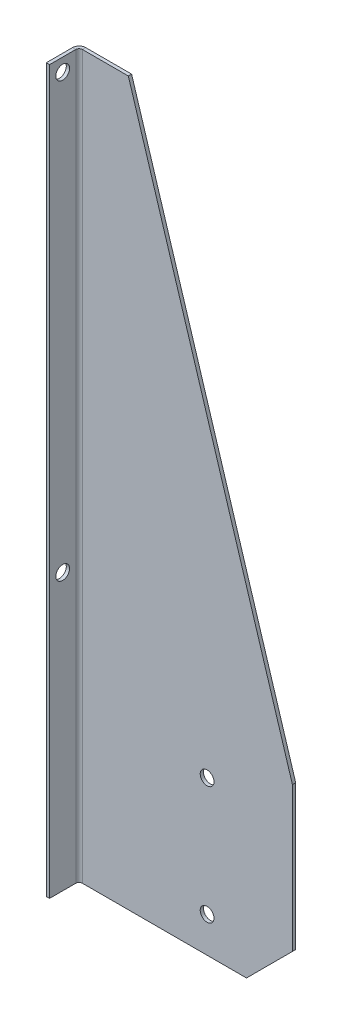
ISO-10303-21;
HEADER;
FILE_DESCRIPTION(('STEP AP214'),'2;1');
FILE_NAME('part.step','',(''),(''),'','','');
FILE_SCHEMA(('AUTOMOTIVE_DESIGN { 1 0 10303 214 1 1 1 1 }'));
ENDSEC;
DATA;
#1=APPLICATION_CONTEXT('core data for automotive mechanical design processes');
#2=APPLICATION_PROTOCOL_DEFINITION('international standard','automotive_design',2000,#1);
#3=PRODUCT_CONTEXT('',#1,'mechanical');
#4=PRODUCT('Part','Part','',(#3));
#5=PRODUCT_RELATED_PRODUCT_CATEGORY('part','',(#4));
#6=PRODUCT_DEFINITION_FORMATION('','',#4);
#7=PRODUCT_DEFINITION_CONTEXT('part definition',#1,'design');
#8=PRODUCT_DEFINITION('design','',#6,#7);
#9=PRODUCT_DEFINITION_SHAPE('','',#8);
#10=(LENGTH_UNIT() NAMED_UNIT(*) SI_UNIT(.MILLI.,.METRE.));
#11=(NAMED_UNIT(*) PLANE_ANGLE_UNIT() SI_UNIT($,.RADIAN.));
#12=(NAMED_UNIT(*) SI_UNIT($,.STERADIAN.) SOLID_ANGLE_UNIT());
#13=UNCERTAINTY_MEASURE_WITH_UNIT(LENGTH_MEASURE(1.E-05),#10,'distance_accuracy_value','');
#14=(GEOMETRIC_REPRESENTATION_CONTEXT(3) GLOBAL_UNCERTAINTY_ASSIGNED_CONTEXT((#13)) GLOBAL_UNIT_ASSIGNED_CONTEXT((#10,
#11,#12)) REPRESENTATION_CONTEXT('',''));
#15=CARTESIAN_POINT('',(0.,0.,0.));
#16=DIRECTION('',(0.,0.,1.));
#17=DIRECTION('',(1.,0.,0.));
#18=AXIS2_PLACEMENT_3D('',#15,#16,#17);
#19=CARTESIAN_POINT('',(5.,550.,-25.));
#20=DIRECTION('',(0.,1.,0.));
#21=DIRECTION('',(0.,0.,1.));
#22=AXIS2_PLACEMENT_3D('',#19,#20,#21);
#23=PLANE('',#22);
#24=DIRECTION('',(0.,0.,1.));
#25=VECTOR('',#24,1.);
#26=CARTESIAN_POINT('',(5.,550.,-25.));
#27=LINE('',#26,#25);
#28=CARTESIAN_POINT('',(5.,550.,-25.));
#29=VERTEX_POINT('',#28);
#30=CARTESIAN_POINT('',(5.,550.,-22.5));
#31=VERTEX_POINT('',#30);
#32=EDGE_CURVE('E227',#29,#31,#27,.T.);
#33=ORIENTED_EDGE('',*,*,#32,.F.);
#34=CARTESIAN_POINT('',(5.,550.,-20.));
#35=DIRECTION('',(0.,1.,0.));
#36=DIRECTION('',(0.,0.,1.));
#37=AXIS2_PLACEMENT_3D('',#34,#35,#36);
#38=CIRCLE('',#37,5.);
#39=CARTESIAN_POINT('',(0.,550.,-20.));
#40=VERTEX_POINT('',#39);
#41=EDGE_CURVE('E143',#40,#29,#38,.F.);
#42=ORIENTED_EDGE('',*,*,#41,.F.);
#43=DIRECTION('',(-1.,0.,0.));
#44=VECTOR('',#43,1.);
#45=CARTESIAN_POINT('',(2.5,550.,-20.));
#46=LINE('',#45,#44);
#47=CARTESIAN_POINT('',(2.5,550.,-20.));
#48=VERTEX_POINT('',#47);
#49=EDGE_CURVE('E224',#48,#40,#46,.T.);
#50=ORIENTED_EDGE('',*,*,#49,.F.);
#51=CARTESIAN_POINT('',(5.,550.,-20.));
#52=DIRECTION('',(0.,1.,0.));
#53=DIRECTION('',(1.,0.,0.));
#54=AXIS2_PLACEMENT_3D('',#51,#52,#53);
#55=CIRCLE('',#54,2.5);
#56=EDGE_CURVE('E198',#48,#31,#55,.F.);
#57=ORIENTED_EDGE('',*,*,#56,.T.);
#58=EDGE_LOOP('',(#33,#42,#50,#57));
#59=FACE_BOUND('',#58,.T.);
#60=ADVANCED_FACE('F38',(#59),#23,.T.);
#61=CARTESIAN_POINT('',(2.5,550.,-20.));
#62=DIRECTION('',(0.,1.,0.));
#63=DIRECTION('',(0.,0.,1.));
#64=AXIS2_PLACEMENT_3D('',#61,#62,#63);
#65=PLANE('',#64);
#66=DIRECTION('',(1.,0.,0.));
#67=VECTOR('',#66,1.);
#68=CARTESIAN_POINT('',(0.,550.,-22.5));
#69=LINE('',#68,#67);
#70=CARTESIAN_POINT('',(39.9999999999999,550.,-22.5));
#71=VERTEX_POINT('',#70);
#72=EDGE_CURVE('E177',#31,#71,#69,.T.);
#73=ORIENTED_EDGE('',*,*,#72,.T.);
#74=DIRECTION('',(0.,0.,-1.));
#75=VECTOR('',#74,1.);
#76=CARTESIAN_POINT('',(39.9999999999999,550.,-20.));
#77=LINE('',#76,#75);
#78=CARTESIAN_POINT('',(39.9999999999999,550.,-25.));
#79=VERTEX_POINT('',#78);
#80=EDGE_CURVE('E236',#71,#79,#77,.T.);
#81=ORIENTED_EDGE('',*,*,#80,.T.);
#82=DIRECTION('',(1.,0.,0.));
#83=VECTOR('',#82,1.);
#84=CARTESIAN_POINT('',(0.,550.,-25.));
#85=LINE('',#84,#83);
#86=EDGE_CURVE('E181',#29,#79,#85,.T.);
#87=ORIENTED_EDGE('',*,*,#86,.F.);
#88=ORIENTED_EDGE('',*,*,#32,.T.);
#89=EDGE_LOOP('',(#73,#81,#87,#88));
#90=FACE_BOUND('',#89,.T.);
#91=ADVANCED_FACE('F303',(#90),#65,.T.);
#92=CARTESIAN_POINT('',(0.,0.,-20.));
#93=DIRECTION('',(0.,-1.,0.));
#94=DIRECTION('',(0.,0.,-1.));
#95=AXIS2_PLACEMENT_3D('',#92,#93,#94);
#96=PLANE('',#95);
#97=DIRECTION('',(1.,0.,0.));
#98=VECTOR('',#97,1.);
#99=CARTESIAN_POINT('',(0.,0.,-20.));
#100=LINE('',#99,#98);
#101=CARTESIAN_POINT('',(0.,0.,-20.));
#102=VERTEX_POINT('',#101);
#103=CARTESIAN_POINT('',(2.5,0.,-20.));
#104=VERTEX_POINT('',#103);
#105=EDGE_CURVE('E130',#102,#104,#100,.T.);
#106=ORIENTED_EDGE('',*,*,#105,.F.);
#107=CARTESIAN_POINT('',(5.,0.,-20.));
#108=DIRECTION('',(0.,1.,0.));
#109=DIRECTION('',(0.,0.,1.));
#110=AXIS2_PLACEMENT_3D('',#107,#108,#109);
#111=CIRCLE('',#110,5.);
#112=CARTESIAN_POINT('',(5.,0.,-25.));
#113=VERTEX_POINT('',#112);
#114=EDGE_CURVE('E140',#102,#113,#111,.F.);
#115=ORIENTED_EDGE('',*,*,#114,.T.);
#116=DIRECTION('',(0.,0.,-1.));
#117=VECTOR('',#116,1.);
#118=CARTESIAN_POINT('',(5.,0.,-22.5));
#119=LINE('',#118,#117);
#120=CARTESIAN_POINT('',(5.,0.,-22.5));
#121=VERTEX_POINT('',#120);
#122=EDGE_CURVE('E117',#121,#113,#119,.T.);
#123=ORIENTED_EDGE('',*,*,#122,.F.);
#124=CARTESIAN_POINT('',(5.,0.,-20.));
#125=DIRECTION('',(0.,1.,0.));
#126=DIRECTION('',(1.,0.,0.));
#127=AXIS2_PLACEMENT_3D('',#124,#125,#126);
#128=CIRCLE('',#127,2.5);
#129=EDGE_CURVE('E174',#104,#121,#128,.F.);
#130=ORIENTED_EDGE('',*,*,#129,.F.);
#131=EDGE_LOOP('',(#106,#115,#123,#130));
#132=FACE_BOUND('',#131,.T.);
#133=ADVANCED_FACE('F155',(#132),#96,.T.);
#134=CARTESIAN_POINT('',(5.,0.,-22.5));
#135=DIRECTION('',(0.,-1.,0.));
#136=DIRECTION('',(0.,0.,-1.));
#137=AXIS2_PLACEMENT_3D('',#134,#135,#136);
#138=PLANE('',#137);
#139=DIRECTION('',(0.,0.,-1.));
#140=VECTOR('',#139,1.);
#141=CARTESIAN_POINT('',(0.,0.,0.));
#142=LINE('',#141,#140);
#143=CARTESIAN_POINT('',(0.,0.,0.));
#144=VERTEX_POINT('',#143);
#145=EDGE_CURVE('E158',#144,#102,#142,.T.);
#146=ORIENTED_EDGE('',*,*,#145,.T.);
#147=ORIENTED_EDGE('',*,*,#105,.T.);
#148=DIRECTION('',(0.,0.,-1.));
#149=VECTOR('',#148,1.);
#150=CARTESIAN_POINT('',(2.5,0.,0.));
#151=LINE('',#150,#149);
#152=CARTESIAN_POINT('',(2.5,0.,0.));
#153=VERTEX_POINT('',#152);
#154=EDGE_CURVE('E170',#153,#104,#151,.T.);
#155=ORIENTED_EDGE('',*,*,#154,.F.);
#156=DIRECTION('',(-1.,0.,0.));
#157=VECTOR('',#156,1.);
#158=CARTESIAN_POINT('',(2.5,0.,0.));
#159=LINE('',#158,#157);
#160=EDGE_CURVE('E163',#153,#144,#159,.T.);
#161=ORIENTED_EDGE('',*,*,#160,.T.);
#162=EDGE_LOOP('',(#146,#147,#155,#161));
#163=FACE_BOUND('',#162,.T.);
#164=ADVANCED_FACE('F294',(#163),#138,.T.);
#165=CARTESIAN_POINT('',(0.,550.,-22.5));
#166=DIRECTION('',(0.,0.,-1.));
#167=DIRECTION('',(-1.,0.,0.));
#168=AXIS2_PLACEMENT_3D('',#165,#166,#167);
#169=PLANE('',#168);
#170=CARTESIAN_POINT('',(99.9999999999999,27.,-22.5));
#171=DIRECTION('',(0.,0.,1.));
#172=DIRECTION('',(1.,0.,0.));
#173=AXIS2_PLACEMENT_3D('',#170,#171,#172);
#174=CIRCLE('',#173,5.24999999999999);
#175=CARTESIAN_POINT('',(105.25,27.,-22.5));
#176=VERTEX_POINT('',#175);
#177=EDGE_CURVE('E250',#176,#176,#174,.T.);
#178=ORIENTED_EDGE('',*,*,#177,.F.);
#179=EDGE_LOOP('',(#178));
#180=FACE_BOUND('',#179,.T.);
#181=CARTESIAN_POINT('',(99.9999999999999,117.,-22.5));
#182=DIRECTION('',(0.,0.,1.));
#183=DIRECTION('',(1.,0.,0.));
#184=AXIS2_PLACEMENT_3D('',#181,#182,#183);
#185=CIRCLE('',#184,5.24999999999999);
#186=CARTESIAN_POINT('',(105.25,117.,-22.5));
#187=VERTEX_POINT('',#186);
#188=EDGE_CURVE('E272',#187,#187,#185,.T.);
#189=ORIENTED_EDGE('',*,*,#188,.F.);
#190=EDGE_LOOP('',(#189));
#191=FACE_BOUND('',#190,.T.);
#192=DIRECTION('',(1.,0.,0.));
#193=VECTOR('',#192,1.);
#194=CARTESIAN_POINT('',(0.,0.,-22.5));
#195=LINE('',#194,#193);
#196=CARTESIAN_POINT('',(130.,0.,-22.5));
#197=VERTEX_POINT('',#196);
#198=EDGE_CURVE('E124',#121,#197,#195,.T.);
#199=ORIENTED_EDGE('',*,*,#198,.T.);
#200=DIRECTION('',(0.707106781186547,0.707106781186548,0.));
#201=VECTOR('',#200,1.);
#202=CARTESIAN_POINT('',(130.,0.,-22.5));
#203=LINE('',#202,#201);
#204=CARTESIAN_POINT('',(165.,35.,-22.5));
#205=VERTEX_POINT('',#204);
#206=EDGE_CURVE('E62',#197,#205,#203,.T.);
#207=ORIENTED_EDGE('',*,*,#206,.T.);
#208=DIRECTION('',(0.,-1.,0.));
#209=VECTOR('',#208,1.);
#210=CARTESIAN_POINT('',(165.,550.,-22.5));
#211=LINE('',#210,#209);
#212=CARTESIAN_POINT('',(165.,144.999999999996,-22.5));
#213=VERTEX_POINT('',#212);
#214=EDGE_CURVE('E131',#213,#205,#211,.T.);
#215=ORIENTED_EDGE('',*,*,#214,.F.);
#216=DIRECTION('',(0.294914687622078,-0.955523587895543,0.));
#217=VECTOR('',#216,1.);
#218=CARTESIAN_POINT('',(165.,144.999999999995,-22.5));
#219=LINE('',#218,#217);
#220=EDGE_CURVE('E234',#213,#71,#219,.F.);
#221=ORIENTED_EDGE('',*,*,#220,.T.);
#222=ORIENTED_EDGE('',*,*,#72,.F.);
#223=DIRECTION('',(0.,-1.,0.));
#224=VECTOR('',#223,1.);
#225=CARTESIAN_POINT('',(5.,550.,-22.5));
#226=LINE('',#225,#224);
#227=EDGE_CURVE('E202',#31,#121,#226,.T.);
#228=ORIENTED_EDGE('',*,*,#227,.T.);
#229=EDGE_LOOP('',(#199,#207,#215,#221,#222,#228));
#230=FACE_BOUND('',#229,.T.);
#231=ADVANCED_FACE('F280',(#180,#191,#230),#169,.F.);
#232=CARTESIAN_POINT('',(165.,550.,-25.));
#233=DIRECTION('',(1.,0.,0.));
#234=DIRECTION('',(0.,0.,-1.));
#235=AXIS2_PLACEMENT_3D('',#232,#233,#234);
#236=PLANE('',#235);
#237=ORIENTED_EDGE('',*,*,#214,.T.);
#238=DIRECTION('',(0.,0.,-1.));
#239=VECTOR('',#238,1.);
#240=CARTESIAN_POINT('',(165.,35.,-25.));
#241=LINE('',#240,#239);
#242=CARTESIAN_POINT('',(165.,35.,-25.));
#243=VERTEX_POINT('',#242);
#244=EDGE_CURVE('E47',#205,#243,#241,.T.);
#245=ORIENTED_EDGE('',*,*,#244,.T.);
#246=DIRECTION('',(0.,-1.,0.));
#247=VECTOR('',#246,1.);
#248=CARTESIAN_POINT('',(165.,550.,-25.));
#249=LINE('',#248,#247);
#250=CARTESIAN_POINT('',(165.,144.999999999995,-25.));
#251=VERTEX_POINT('',#250);
#252=EDGE_CURVE('E148',#251,#243,#249,.T.);
#253=ORIENTED_EDGE('',*,*,#252,.F.);
#254=DIRECTION('',(0.,0.,1.));
#255=VECTOR('',#254,1.);
#256=CARTESIAN_POINT('',(165.,144.999999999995,-25.));
#257=LINE('',#256,#255);
#258=EDGE_CURVE('E230',#251,#213,#257,.T.);
#259=ORIENTED_EDGE('',*,*,#258,.T.);
#260=EDGE_LOOP('',(#237,#245,#253,#259));
#261=FACE_BOUND('',#260,.T.);
#262=ADVANCED_FACE('F309',(#261),#236,.T.);
#263=CARTESIAN_POINT('',(0.,550.,-25.));
#264=DIRECTION('',(0.,0.,-1.));
#265=DIRECTION('',(-1.,0.,0.));
#266=AXIS2_PLACEMENT_3D('',#263,#264,#265);
#267=PLANE('',#266);
#268=CARTESIAN_POINT('',(99.9999999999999,27.,-25.));
#269=DIRECTION('',(0.,0.,1.));
#270=DIRECTION('',(1.,0.,0.));
#271=AXIS2_PLACEMENT_3D('',#268,#269,#270);
#272=CIRCLE('',#271,5.25);
#273=CARTESIAN_POINT('',(105.25,27.,-25.));
#274=VERTEX_POINT('',#273);
#275=EDGE_CURVE('E257',#274,#274,#272,.T.);
#276=ORIENTED_EDGE('',*,*,#275,.T.);
#277=EDGE_LOOP('',(#276));
#278=FACE_BOUND('',#277,.T.);
#279=CARTESIAN_POINT('',(99.9999999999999,117.,-25.));
#280=DIRECTION('',(0.,0.,1.));
#281=DIRECTION('',(1.,0.,0.));
#282=AXIS2_PLACEMENT_3D('',#279,#280,#281);
#283=CIRCLE('',#282,5.25);
#284=CARTESIAN_POINT('',(105.25,117.,-25.));
#285=VERTEX_POINT('',#284);
#286=EDGE_CURVE('E276',#285,#285,#283,.T.);
#287=ORIENTED_EDGE('',*,*,#286,.T.);
#288=EDGE_LOOP('',(#287));
#289=FACE_BOUND('',#288,.T.);
#290=ORIENTED_EDGE('',*,*,#252,.T.);
#291=DIRECTION('',(-0.707106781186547,-0.707106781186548,0.));
#292=VECTOR('',#291,1.);
#293=CARTESIAN_POINT('',(340.,210.,-25.));
#294=LINE('',#293,#292);
#295=CARTESIAN_POINT('',(130.,0.,-25.));
#296=VERTEX_POINT('',#295);
#297=EDGE_CURVE('E11',#243,#296,#294,.T.);
#298=ORIENTED_EDGE('',*,*,#297,.T.);
#299=DIRECTION('',(1.,0.,0.));
#300=VECTOR('',#299,1.);
#301=CARTESIAN_POINT('',(0.,0.,-25.));
#302=LINE('',#301,#300);
#303=EDGE_CURVE('E122',#113,#296,#302,.T.);
#304=ORIENTED_EDGE('',*,*,#303,.F.);
#305=DIRECTION('',(0.,-1.,0.));
#306=VECTOR('',#305,1.);
#307=CARTESIAN_POINT('',(5.,550.,-25.));
#308=LINE('',#307,#306);
#309=EDGE_CURVE('E137',#29,#113,#308,.T.);
#310=ORIENTED_EDGE('',*,*,#309,.F.);
#311=ORIENTED_EDGE('',*,*,#86,.T.);
#312=DIRECTION('',(-0.294914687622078,0.955523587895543,0.));
#313=VECTOR('',#312,1.);
#314=CARTESIAN_POINT('',(36.5210130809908,561.27191761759,-25.));
#315=LINE('',#314,#313);
#316=EDGE_CURVE('E239',#79,#251,#315,.F.);
#317=ORIENTED_EDGE('',*,*,#316,.T.);
#318=EDGE_LOOP('',(#290,#298,#304,#310,#311,#317));
#319=FACE_BOUND('',#318,.T.);
#320=ADVANCED_FACE('F151',(#278,#289,#319),#267,.T.);
#321=CARTESIAN_POINT('',(5.,550.,-20.));
#322=DIRECTION('',(0.,-1.,0.));
#323=DIRECTION('',(0.,0.,-1.));
#324=AXIS2_PLACEMENT_3D('',#321,#322,#323);
#325=CYLINDRICAL_SURFACE('',#324,5.);
#326=ORIENTED_EDGE('',*,*,#114,.F.);
#327=DIRECTION('',(0.,-1.,0.));
#328=VECTOR('',#327,1.);
#329=CARTESIAN_POINT('',(0.,550.,-20.));
#330=LINE('',#329,#328);
#331=EDGE_CURVE('E149',#40,#102,#330,.T.);
#332=ORIENTED_EDGE('',*,*,#331,.F.);
#333=ORIENTED_EDGE('',*,*,#41,.T.);
#334=ORIENTED_EDGE('',*,*,#309,.T.);
#335=EDGE_LOOP('',(#326,#332,#333,#334));
#336=FACE_BOUND('',#335,.T.);
#337=ADVANCED_FACE('F138',(#336),#325,.T.);
#338=CARTESIAN_POINT('',(0.,550.,0.));
#339=DIRECTION('',(-1.,0.,0.));
#340=DIRECTION('',(0.,0.,1.));
#341=AXIS2_PLACEMENT_3D('',#338,#339,#340);
#342=PLANE('',#341);
#343=CARTESIAN_POINT('',(0.,210.,-10.0000000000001));
#344=DIRECTION('',(-1.,0.,0.));
#345=DIRECTION('',(0.,0.,1.));
#346=AXIS2_PLACEMENT_3D('',#343,#344,#345);
#347=CIRCLE('',#346,5.24999999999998);
#348=CARTESIAN_POINT('',(0.,210.,-4.7500000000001));
#349=VERTEX_POINT('',#348);
#350=EDGE_CURVE('E266',#349,#349,#347,.T.);
#351=ORIENTED_EDGE('',*,*,#350,.F.);
#352=EDGE_LOOP('',(#351));
#353=FACE_BOUND('',#352,.T.);
#354=CARTESIAN_POINT('',(0.,540.,-10.));
#355=DIRECTION('',(-1.,0.,0.));
#356=DIRECTION('',(0.,0.,1.));
#357=AXIS2_PLACEMENT_3D('',#354,#355,#356);
#358=CIRCLE('',#357,5.24999999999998);
#359=CARTESIAN_POINT('',(0.,540.,-4.75000000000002));
#360=VERTEX_POINT('',#359);
#361=EDGE_CURVE('E251',#360,#360,#358,.T.);
#362=ORIENTED_EDGE('',*,*,#361,.F.);
#363=EDGE_LOOP('',(#362));
#364=FACE_BOUND('',#363,.T.);
#365=ORIENTED_EDGE('',*,*,#145,.F.);
#366=DIRECTION('',(0.,-1.,0.));
#367=VECTOR('',#366,1.);
#368=CARTESIAN_POINT('',(0.,550.,0.));
#369=LINE('',#368,#367);
#370=CARTESIAN_POINT('',(0.,550.,0.));
#371=VERTEX_POINT('',#370);
#372=EDGE_CURVE('E213',#371,#144,#369,.T.);
#373=ORIENTED_EDGE('',*,*,#372,.F.);
#374=DIRECTION('',(0.,0.,-1.));
#375=VECTOR('',#374,1.);
#376=CARTESIAN_POINT('',(0.,550.,0.));
#377=LINE('',#376,#375);
#378=EDGE_CURVE('E186',#371,#40,#377,.T.);
#379=ORIENTED_EDGE('',*,*,#378,.T.);
#380=ORIENTED_EDGE('',*,*,#331,.T.);
#381=EDGE_LOOP('',(#365,#373,#379,#380));
#382=FACE_BOUND('',#381,.T.);
#383=ADVANCED_FACE('F300',(#353,#364,#382),#342,.T.);
#384=CARTESIAN_POINT('',(2.5,550.,0.));
#385=DIRECTION('',(0.,0.,1.));
#386=DIRECTION('',(1.,0.,0.));
#387=AXIS2_PLACEMENT_3D('',#384,#385,#386);
#388=PLANE('',#387);
#389=ORIENTED_EDGE('',*,*,#160,.F.);
#390=DIRECTION('',(0.,-1.,0.));
#391=VECTOR('',#390,1.);
#392=CARTESIAN_POINT('',(2.5,550.,0.));
#393=LINE('',#392,#391);
#394=CARTESIAN_POINT('',(2.5,550.,0.));
#395=VERTEX_POINT('',#394);
#396=EDGE_CURVE('E210',#395,#153,#393,.T.);
#397=ORIENTED_EDGE('',*,*,#396,.F.);
#398=DIRECTION('',(-1.,0.,0.));
#399=VECTOR('',#398,1.);
#400=CARTESIAN_POINT('',(2.5,550.,0.));
#401=LINE('',#400,#399);
#402=EDGE_CURVE('E190',#395,#371,#401,.T.);
#403=ORIENTED_EDGE('',*,*,#402,.T.);
#404=ORIENTED_EDGE('',*,*,#372,.T.);
#405=EDGE_LOOP('',(#389,#397,#403,#404));
#406=FACE_BOUND('',#405,.T.);
#407=ADVANCED_FACE('F296',(#406),#388,.T.);
#408=CARTESIAN_POINT('',(2.5,550.,0.));
#409=DIRECTION('',(-1.,0.,0.));
#410=DIRECTION('',(0.,0.,1.));
#411=AXIS2_PLACEMENT_3D('',#408,#409,#410);
#412=PLANE('',#411);
#413=CARTESIAN_POINT('',(2.5,210.,-10.0000000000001));
#414=DIRECTION('',(-1.,0.,0.));
#415=DIRECTION('',(0.,0.,1.));
#416=AXIS2_PLACEMENT_3D('',#413,#414,#415);
#417=CIRCLE('',#416,5.24999999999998);
#418=CARTESIAN_POINT('',(2.5,210.,-4.7500000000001));
#419=VERTEX_POINT('',#418);
#420=EDGE_CURVE('E41',#419,#419,#417,.T.);
#421=ORIENTED_EDGE('',*,*,#420,.T.);
#422=EDGE_LOOP('',(#421));
#423=FACE_BOUND('',#422,.T.);
#424=CARTESIAN_POINT('',(2.5,540.,-10.));
#425=DIRECTION('',(-1.,0.,0.));
#426=DIRECTION('',(0.,0.,1.));
#427=AXIS2_PLACEMENT_3D('',#424,#425,#426);
#428=CIRCLE('',#427,5.24999999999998);
#429=CARTESIAN_POINT('',(2.5,540.,-4.75000000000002));
#430=VERTEX_POINT('',#429);
#431=EDGE_CURVE('E247',#430,#430,#428,.T.);
#432=ORIENTED_EDGE('',*,*,#431,.T.);
#433=EDGE_LOOP('',(#432));
#434=FACE_BOUND('',#433,.T.);
#435=ORIENTED_EDGE('',*,*,#154,.T.);
#436=DIRECTION('',(0.,-1.,0.));
#437=VECTOR('',#436,1.);
#438=CARTESIAN_POINT('',(2.5,550.,-20.));
#439=LINE('',#438,#437);
#440=EDGE_CURVE('E206',#48,#104,#439,.T.);
#441=ORIENTED_EDGE('',*,*,#440,.F.);
#442=DIRECTION('',(0.,0.,-1.));
#443=VECTOR('',#442,1.);
#444=CARTESIAN_POINT('',(2.5,550.,0.));
#445=LINE('',#444,#443);
#446=EDGE_CURVE('E194',#395,#48,#445,.T.);
#447=ORIENTED_EDGE('',*,*,#446,.F.);
#448=ORIENTED_EDGE('',*,*,#396,.T.);
#449=EDGE_LOOP('',(#435,#441,#447,#448));
#450=FACE_BOUND('',#449,.T.);
#451=ADVANCED_FACE('F289',(#423,#434,#450),#412,.F.);
#452=CARTESIAN_POINT('',(5.,550.,-20.));
#453=DIRECTION('',(0.,-1.,0.));
#454=DIRECTION('',(0.,0.,-1.));
#455=AXIS2_PLACEMENT_3D('',#452,#453,#454);
#456=CYLINDRICAL_SURFACE('',#455,2.5);
#457=ORIENTED_EDGE('',*,*,#129,.T.);
#458=ORIENTED_EDGE('',*,*,#227,.F.);
#459=ORIENTED_EDGE('',*,*,#56,.F.);
#460=ORIENTED_EDGE('',*,*,#440,.T.);
#461=EDGE_LOOP('',(#457,#458,#459,#460));
#462=FACE_BOUND('',#461,.T.);
#463=ADVANCED_FACE('F285',(#462),#456,.F.);
#464=CARTESIAN_POINT('',(5.,550.,-20.));
#465=DIRECTION('',(0.,1.,0.));
#466=DIRECTION('',(0.,0.,1.));
#467=AXIS2_PLACEMENT_3D('',#464,#465,#466);
#468=PLANE('',#467);
#469=ORIENTED_EDGE('',*,*,#446,.T.);
#470=ORIENTED_EDGE('',*,*,#49,.T.);
#471=ORIENTED_EDGE('',*,*,#378,.F.);
#472=ORIENTED_EDGE('',*,*,#402,.F.);
#473=EDGE_LOOP('',(#469,#470,#471,#472));
#474=FACE_BOUND('',#473,.T.);
#475=ADVANCED_FACE('F354',(#474),#468,.T.);
#476=CARTESIAN_POINT('',(5.,0.,-20.));
#477=DIRECTION('',(0.,1.,0.));
#478=DIRECTION('',(0.,0.,1.));
#479=AXIS2_PLACEMENT_3D('',#476,#477,#478);
#480=PLANE('',#479);
#481=ORIENTED_EDGE('',*,*,#303,.T.);
#482=DIRECTION('',(0.,0.,1.));
#483=VECTOR('',#482,1.);
#484=CARTESIAN_POINT('',(130.,0.,-22.5));
#485=LINE('',#484,#483);
#486=EDGE_CURVE('E241',#296,#197,#485,.T.);
#487=ORIENTED_EDGE('',*,*,#486,.T.);
#488=ORIENTED_EDGE('',*,*,#198,.F.);
#489=ORIENTED_EDGE('',*,*,#122,.T.);
#490=EDGE_LOOP('',(#481,#487,#488,#489));
#491=FACE_BOUND('',#490,.T.);
#492=ADVANCED_FACE('F119',(#491),#480,.F.);
#493=CARTESIAN_POINT('',(165.,144.999999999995,-25.));
#494=DIRECTION('',(-0.955523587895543,-0.294914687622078,0.));
#495=DIRECTION('',(0.294914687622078,-0.955523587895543,0.));
#496=AXIS2_PLACEMENT_3D('',#493,#494,#495);
#497=PLANE('',#496);
#498=ORIENTED_EDGE('',*,*,#316,.F.);
#499=ORIENTED_EDGE('',*,*,#80,.F.);
#500=ORIENTED_EDGE('',*,*,#220,.F.);
#501=ORIENTED_EDGE('',*,*,#258,.F.);
#502=EDGE_LOOP('',(#498,#499,#500,#501));
#503=FACE_BOUND('',#502,.T.);
#504=ADVANCED_FACE('F308',(#503),#497,.F.);
#505=CARTESIAN_POINT('',(130.,0.,-20.));
#506=DIRECTION('',(0.707106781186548,-0.707106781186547,0.));
#507=DIRECTION('',(0.707106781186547,0.707106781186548,0.));
#508=AXIS2_PLACEMENT_3D('',#505,#506,#507);
#509=PLANE('',#508);
#510=ORIENTED_EDGE('',*,*,#297,.F.);
#511=ORIENTED_EDGE('',*,*,#244,.F.);
#512=ORIENTED_EDGE('',*,*,#206,.F.);
#513=ORIENTED_EDGE('',*,*,#486,.F.);
#514=EDGE_LOOP('',(#510,#511,#512,#513));
#515=FACE_BOUND('',#514,.T.);
#516=ADVANCED_FACE('F311',(#515),#509,.T.);
#517=CARTESIAN_POINT('',(99.9999999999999,117.,-22.5));
#518=DIRECTION('',(0.,0.,1.));
#519=DIRECTION('',(1.,0.,0.));
#520=AXIS2_PLACEMENT_3D('',#517,#518,#519);
#521=CYLINDRICAL_SURFACE('',#520,5.25);
#522=ORIENTED_EDGE('',*,*,#286,.F.);
#523=EDGE_LOOP('',(#522));
#524=FACE_BOUND('',#523,.T.);
#525=ORIENTED_EDGE('',*,*,#188,.T.);
#526=EDGE_LOOP('',(#525));
#527=FACE_BOUND('',#526,.T.);
#528=ADVANCED_FACE('F313',(#524,#527),#521,.F.);
#529=CARTESIAN_POINT('',(99.9999999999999,27.,-22.5));
#530=DIRECTION('',(0.,0.,1.));
#531=DIRECTION('',(1.,0.,0.));
#532=AXIS2_PLACEMENT_3D('',#529,#530,#531);
#533=CYLINDRICAL_SURFACE('',#532,5.25);
#534=ORIENTED_EDGE('',*,*,#275,.F.);
#535=EDGE_LOOP('',(#534));
#536=FACE_BOUND('',#535,.T.);
#537=ORIENTED_EDGE('',*,*,#177,.T.);
#538=EDGE_LOOP('',(#537));
#539=FACE_BOUND('',#538,.T.);
#540=ADVANCED_FACE('F319',(#536,#539),#533,.F.);
#541=CARTESIAN_POINT('',(0.,540.,-10.));
#542=DIRECTION('',(-1.,0.,0.));
#543=DIRECTION('',(0.,0.,1.));
#544=AXIS2_PLACEMENT_3D('',#541,#542,#543);
#545=CYLINDRICAL_SURFACE('',#544,5.24999999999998);
#546=ORIENTED_EDGE('',*,*,#361,.T.);
#547=EDGE_LOOP('',(#546));
#548=FACE_BOUND('',#547,.T.);
#549=ORIENTED_EDGE('',*,*,#431,.F.);
#550=EDGE_LOOP('',(#549));
#551=FACE_BOUND('',#550,.T.);
#552=ADVANCED_FACE('F385',(#548,#551),#545,.F.);
#553=CARTESIAN_POINT('',(0.,210.,-10.0000000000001));
#554=DIRECTION('',(-1.,0.,0.));
#555=DIRECTION('',(0.,0.,1.));
#556=AXIS2_PLACEMENT_3D('',#553,#554,#555);
#557=CYLINDRICAL_SURFACE('',#556,5.24999999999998);
#558=ORIENTED_EDGE('',*,*,#350,.T.);
#559=EDGE_LOOP('',(#558));
#560=FACE_BOUND('',#559,.T.);
#561=ORIENTED_EDGE('',*,*,#420,.F.);
#562=EDGE_LOOP('',(#561));
#563=FACE_BOUND('',#562,.T.);
#564=ADVANCED_FACE('F395',(#560,#563),#557,.F.);
#565=CLOSED_SHELL('',(#60,#91,#133,#164,#231,#262,#320,#337,#383,#407,#451,#463,#475,#492,#504,
#516,#528,#540,#552,#564));
#566=MANIFOLD_SOLID_BREP('B2',#565);
#567=ADVANCED_BREP_SHAPE_REPRESENTATION('',(#18,#566),#14);
#568=SHAPE_DEFINITION_REPRESENTATION(#9,#567);
ENDSEC;
END-ISO-10303-21;
